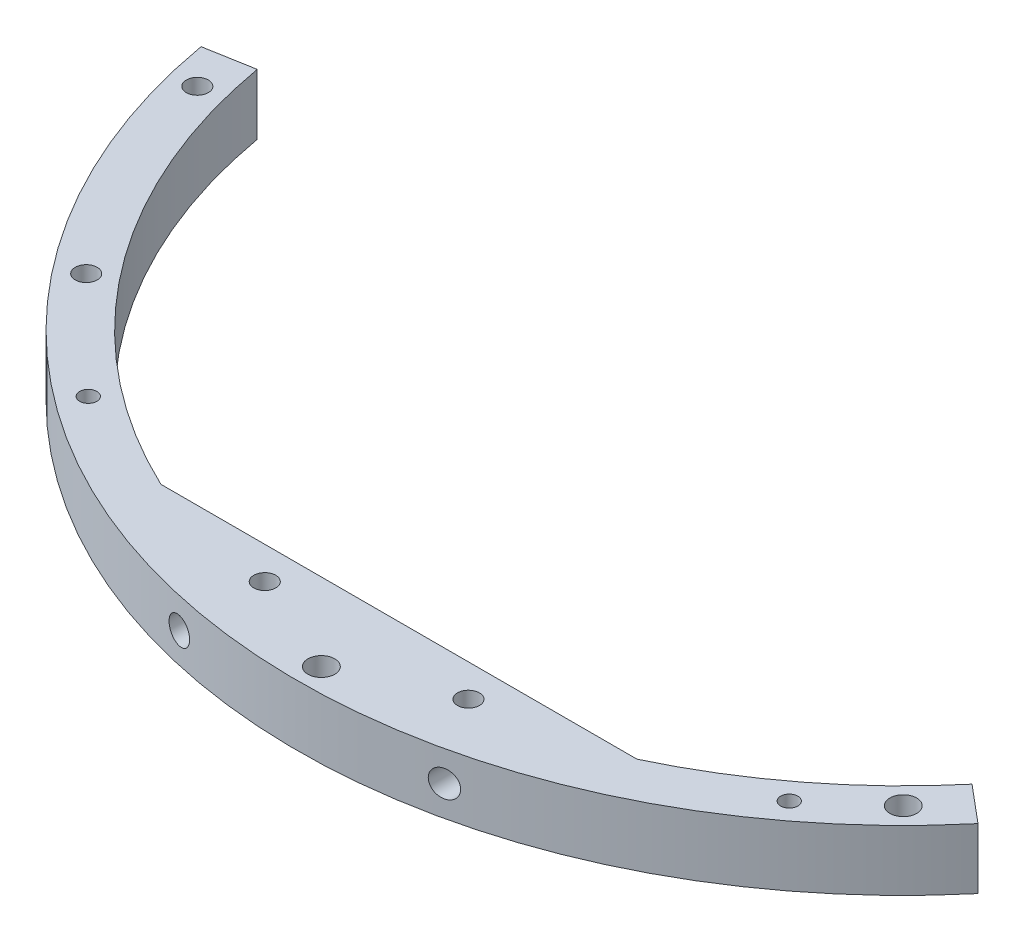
from build123d import *

# Parameters (mm, degrees)
SKETCH1_R          = 1.7272
SKETCH1_R_2        = 1.352549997
SKETCH1_R_3        = 1.352549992
SKETCH1_R_4        = 2.108199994
SKETCH1_R_5        = 2.1082
EXTRUDE1_DEPTH     = 9.525
SKETCH3_R          = 2.0828
CUT_EXTRUDE1_DEPTH = 114.972421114


with BuildPart() as part:
    # Sketch1 → Extrude1 (new body)
    with BuildSketch(Plane(origin=(0, 0, 0), x_dir=(1, 0, 0), z_dir=(0, 1, 0))):
        with BuildLine():
            Line((67.128474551, -56.327478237), (72.965733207, -61.225519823))
            ThreePointArc((72.965733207, -61.225519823), (0, -95.25), (-72.965733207, -61.225519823))
            ThreePointArc((-72.965733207, -61.225519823), (-86.325816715, -40.254389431), (-93.802938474, -16.539988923))
            Line((-93.802938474, -16.539988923), (-86.298703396, -15.216789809))
            ThreePointArc((-86.298703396, -15.216789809), (-79.419751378, -37.034038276), (-67.128474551, -56.327478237))
            ThreePointArc((-67.128474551, -56.327478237), (-53.506037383, -69.398277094), (-37.400152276, -79.248000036))
            Line((-37.400152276, -79.248000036), (37.400152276, -79.248000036))
            ThreePointArc((37.400152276, -79.248000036), (53.506037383, -69.398277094), (67.128474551, -56.327478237))
        make_face()
        with Locations(Location((-16.002, -84.328000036, 0), (0, 0, 90))):
            Circle(SKETCH1_R, mode=Mode.SUBTRACT)
        with Locations(Location((-55.073032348, -72.989793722, 0), (0, 0, 90))):
            Circle(SKETCH1_R_2, mode=Mode.SUBTRACT)
        with Locations(Location((55.073032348, -72.989793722, 0), (0, 0, 90))):
            Circle(SKETCH1_R_3, mode=Mode.SUBTRACT)
        with Locations(Location((64.657844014, -64.65784405, 0), (0, 0, 90))):
            Circle(SKETCH1_R_4, mode=Mode.SUBTRACT)
        with Locations(Location((16.002, -84.328000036, 0), (0, 0, 90))):
            Circle(SKETCH1_R, mode=Mode.SUBTRACT)
        with Locations(Location((0, -91.440000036, 0), (0, 0, 90))):
            Circle(SKETCH1_R_5, mode=Mode.SUBTRACT)
        with Locations(Location((-88.697081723, -22.228389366, 0), (0, 0, 90))):
            Circle(SKETCH1_R, mode=Mode.SUBTRACT)
        with Locations(Location((-71.9390775, -56.445041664, 0), (0, 0, 90))):
            Circle(SKETCH1_R, mode=Mode.SUBTRACT)
    extrude(amount=EXTRUDE1_DEPTH)

    # Sketch3 → Cut-Extrude1 (cut, through all)
    with BuildSketch(Plane(origin=(0, 0, 79.248000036), x_dir=(-1, 0, 0), z_dir=(0, 0, -1))):
        with Locations((20.828, 4.7625)):
            Circle(SKETCH3_R)
        with Locations((-20.828, 4.7625)):
            Circle(SKETCH3_R)
    extrude(amount=-CUT_EXTRUDE1_DEPTH, mode=Mode.SUBTRACT)


solid = part.part
